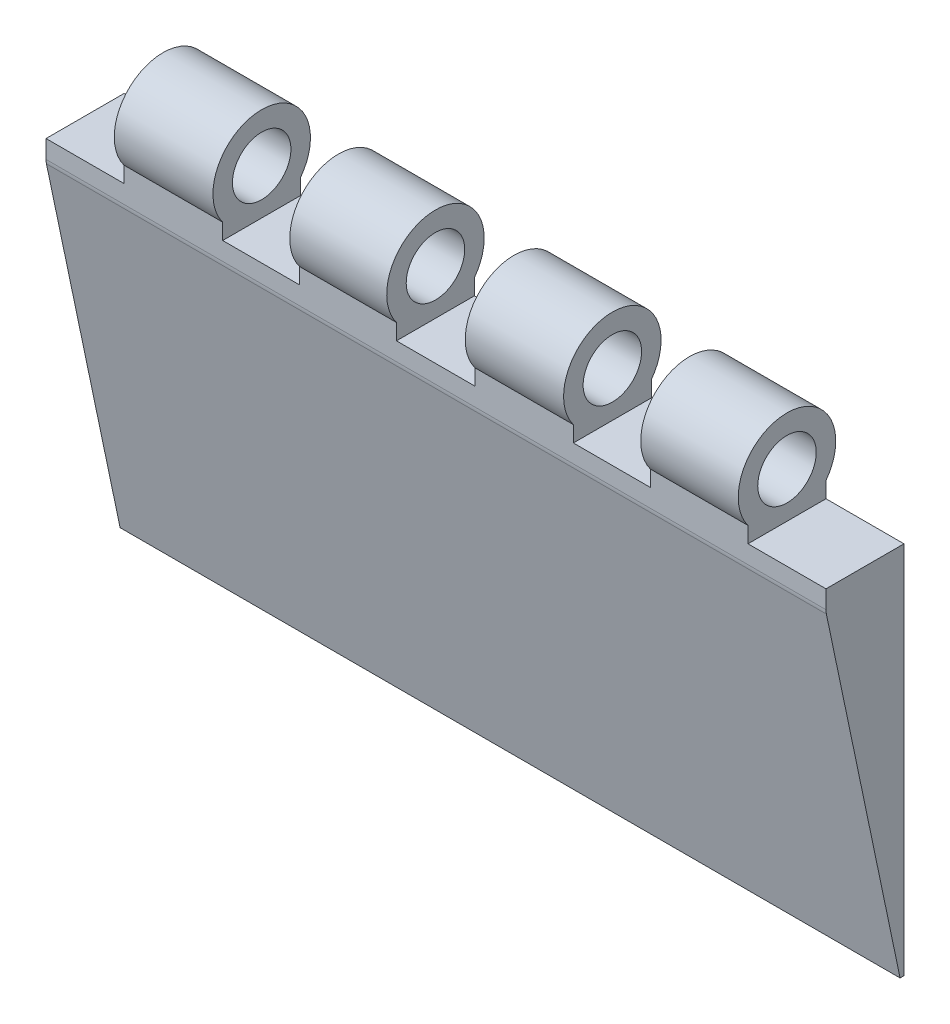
from build123d import *

# Parameters (mm, degrees)
SKETCH1_W               = 4
SKETCH1_H               = 20
BOSS_EXTRUDE1_DEPTH     = 40
SKETCH2_R               = 2.5
SKETCH2_R_2             = 1.5
BOSS_EXTRUDE3_DEPTH     = 40
CUT_EXTRUDE2_DEPTH      = 43.452915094
FILLET1_R               = 1
CUT_EXTRUDE3_DEPTH      = 43.617484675
CUT_EXTRUDE3_DEPTH_BACK = 43.617484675
SKETCH5_W               = 6.253024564
SKETCH5_H               = 8.400962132
SKETCH5_W_2             = 3.939736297
SKETCH5_H_2             = 9.04133694
SKETCH5_W_3             = 4.027853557
SKETCH5_W_4             = 3.955877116
SKETCH5_H_3             = 9.735076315
SKETCH5_W_5             = 4.652087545


with BuildPart() as part:
    # Sketch1 → Boss-Extrude1 (new body)
    with BuildSketch(Plane(origin=(0, 0, 0), x_dir=(0, 0, -1), z_dir=(1, 0, 0))):
        Rectangle(SKETCH1_W, SKETCH1_H)
    extrude(amount=BOSS_EXTRUDE1_DEPTH)

    # Sketch2 → Boss-Extrude3 (add)
    with BuildSketch(Plane.ZY):
        with Locations((0, 11.5)):
            Circle(SKETCH2_R)
        with Locations((0, 11.5)):
            Circle(SKETCH2_R_2, mode=Mode.SUBTRACT)
    extrude(amount=-BOSS_EXTRUDE3_DEPTH)

    # Sketch4 → Cut-Extrude2 (cut, through all)
    with BuildSketch(Plane.ZY):
        Polygon((2, 8.153248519), (-1.8, -10), (5.149137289, -10), (4.693341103, 8.153248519), align=None)
    extrude(amount=-CUT_EXTRUDE2_DEPTH, mode=Mode.SUBTRACT)

    # Fillet1
    fillet1_edges = [part.edges().sort_by_distance(p)[0] for p in [
        (20, 8.153248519, 2),
    ]]
    fillet(fillet1_edges, radius=FILLET1_R)

    # Sketch5 → Cut-Extrude3 (cut, two sides: drawn at the far end of the back side and taken through both)
    with BuildSketch(Plane.XY.offset(2).offset(-CUT_EXTRUDE3_DEPTH_BACK)):
        with Locations((0.873487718, 13.385486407)):
            Rectangle(SKETCH5_W, SKETCH5_H)
        with Locations((11.030131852, 13.705673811)):
            Rectangle(SKETCH5_W_2, SKETCH5_H_2)
        with Locations((19.986073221, 13.705673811)):
            Rectangle(SKETCH5_W_3, SKETCH5_H_2)
        with Locations((29.022061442, 14.052543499)):
            Rectangle(SKETCH5_W_4, SKETCH5_H_3)
        with Locations((38.326043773, 13.385486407)):
            Rectangle(SKETCH5_W_5, SKETCH5_H)
    extrude(amount=CUT_EXTRUDE3_DEPTH + CUT_EXTRUDE3_DEPTH_BACK, mode=Mode.SUBTRACT)


solid = part.part
